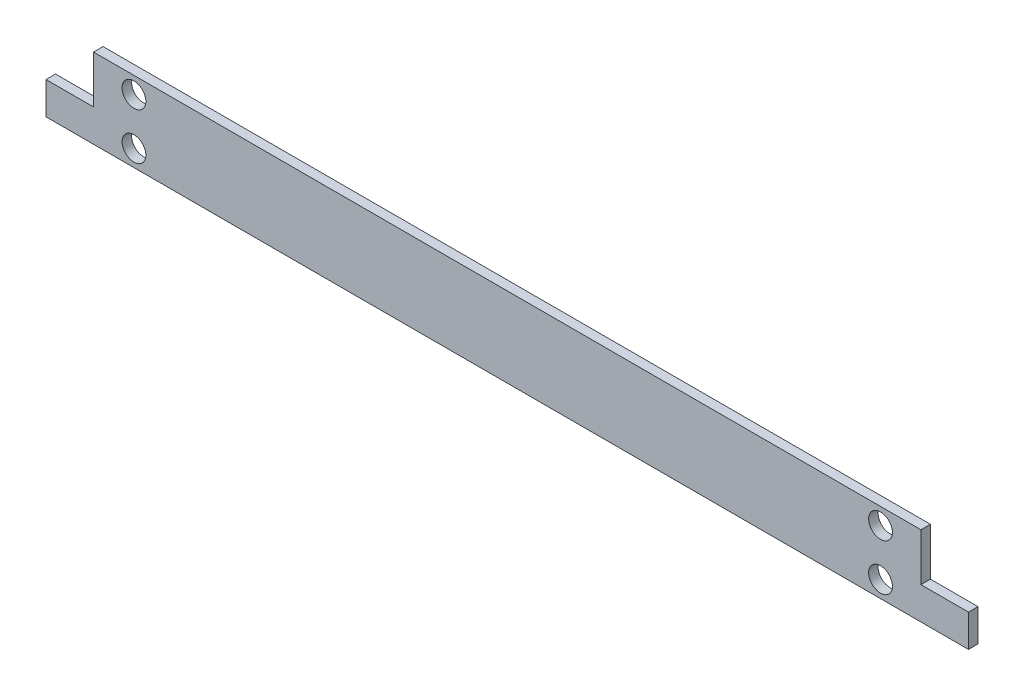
ISO-10303-21;
HEADER;
FILE_DESCRIPTION(('STEP AP214'),'2;1');
FILE_NAME('part.step','',(''),(''),'','','');
FILE_SCHEMA(('AUTOMOTIVE_DESIGN { 1 0 10303 214 1 1 1 1 }'));
ENDSEC;
DATA;
#1=APPLICATION_CONTEXT('core data for automotive mechanical design processes');
#2=APPLICATION_PROTOCOL_DEFINITION('international standard','automotive_design',2000,#1);
#3=PRODUCT_CONTEXT('',#1,'mechanical');
#4=PRODUCT('Part','Part','',(#3));
#5=PRODUCT_RELATED_PRODUCT_CATEGORY('part','',(#4));
#6=PRODUCT_DEFINITION_FORMATION('','',#4);
#7=PRODUCT_DEFINITION_CONTEXT('part definition',#1,'design');
#8=PRODUCT_DEFINITION('design','',#6,#7);
#9=PRODUCT_DEFINITION_SHAPE('','',#8);
#10=(LENGTH_UNIT() NAMED_UNIT(*) SI_UNIT(.MILLI.,.METRE.));
#11=(NAMED_UNIT(*) PLANE_ANGLE_UNIT() SI_UNIT($,.RADIAN.));
#12=(NAMED_UNIT(*) SI_UNIT($,.STERADIAN.) SOLID_ANGLE_UNIT());
#13=UNCERTAINTY_MEASURE_WITH_UNIT(LENGTH_MEASURE(1.E-05),#10,'distance_accuracy_value','');
#14=(GEOMETRIC_REPRESENTATION_CONTEXT(3) GLOBAL_UNCERTAINTY_ASSIGNED_CONTEXT((#13)) GLOBAL_UNIT_ASSIGNED_CONTEXT((#10,
#11,#12)) REPRESENTATION_CONTEXT('',''));
#15=CARTESIAN_POINT('',(0.,0.,0.));
#16=DIRECTION('',(0.,0.,1.));
#17=DIRECTION('',(1.,0.,0.));
#18=AXIS2_PLACEMENT_3D('',#15,#16,#17);
#19=CARTESIAN_POINT('',(233.68,0.,2.54));
#20=DIRECTION('',(1.,0.,0.));
#21=DIRECTION('',(0.,0.,-1.));
#22=AXIS2_PLACEMENT_3D('',#19,#20,#21);
#23=PLANE('',#22);
#24=DIRECTION('',(0.,-1.,0.));
#25=VECTOR('',#24,1.);
#26=CARTESIAN_POINT('',(233.68,0.,0.));
#27=LINE('',#26,#25);
#28=CARTESIAN_POINT('',(233.68,21.336,0.));
#29=VERTEX_POINT('',#28);
#30=CARTESIAN_POINT('',(233.68,8.636,0.));
#31=VERTEX_POINT('',#30);
#32=EDGE_CURVE('E157',#29,#31,#27,.T.);
#33=ORIENTED_EDGE('',*,*,#32,.F.);
#34=DIRECTION('',(0.,0.,-1.));
#35=VECTOR('',#34,1.);
#36=CARTESIAN_POINT('',(233.68,21.336,2.54));
#37=LINE('',#36,#35);
#38=CARTESIAN_POINT('',(233.68,21.336,2.54));
#39=VERTEX_POINT('',#38);
#40=EDGE_CURVE('E11',#39,#29,#37,.T.);
#41=ORIENTED_EDGE('',*,*,#40,.F.);
#42=DIRECTION('',(0.,-1.,0.));
#43=VECTOR('',#42,1.);
#44=CARTESIAN_POINT('',(233.68,0.,2.54));
#45=LINE('',#44,#43);
#46=CARTESIAN_POINT('',(233.68,8.636,2.54));
#47=VERTEX_POINT('',#46);
#48=EDGE_CURVE('E241',#39,#47,#45,.T.);
#49=ORIENTED_EDGE('',*,*,#48,.T.);
#50=DIRECTION('',(0.,0.,-1.));
#51=VECTOR('',#50,1.);
#52=CARTESIAN_POINT('',(233.68,8.636,2.54));
#53=LINE('',#52,#51);
#54=EDGE_CURVE('E87',#47,#31,#53,.T.);
#55=ORIENTED_EDGE('',*,*,#54,.T.);
#56=EDGE_LOOP('',(#33,#41,#49,#55));
#57=FACE_BOUND('',#56,.T.);
#58=ADVANCED_FACE('F36',(#57),#23,.T.);
#59=CARTESIAN_POINT('',(0.,21.336,2.54));
#60=DIRECTION('',(0.,1.,0.));
#61=DIRECTION('',(0.,0.,1.));
#62=AXIS2_PLACEMENT_3D('',#59,#60,#61);
#63=PLANE('',#62);
#64=DIRECTION('',(1.,0.,0.));
#65=VECTOR('',#64,1.);
#66=CARTESIAN_POINT('',(0.,21.336,0.));
#67=LINE('',#66,#65);
#68=CARTESIAN_POINT('',(12.7,21.336,0.));
#69=VERTEX_POINT('',#68);
#70=EDGE_CURVE('E151',#69,#29,#67,.T.);
#71=ORIENTED_EDGE('',*,*,#70,.F.);
#72=DIRECTION('',(0.,0.,-1.));
#73=VECTOR('',#72,1.);
#74=CARTESIAN_POINT('',(12.7,21.336,2.54));
#75=LINE('',#74,#73);
#76=CARTESIAN_POINT('',(12.7,21.336,2.54));
#77=VERTEX_POINT('',#76);
#78=EDGE_CURVE('E45',#77,#69,#75,.T.);
#79=ORIENTED_EDGE('',*,*,#78,.F.);
#80=DIRECTION('',(1.,0.,0.));
#81=VECTOR('',#80,1.);
#82=CARTESIAN_POINT('',(0.,21.336,2.54));
#83=LINE('',#82,#81);
#84=EDGE_CURVE('E243',#77,#39,#83,.T.);
#85=ORIENTED_EDGE('',*,*,#84,.T.);
#86=ORIENTED_EDGE('',*,*,#40,.T.);
#87=EDGE_LOOP('',(#71,#79,#85,#86));
#88=FACE_BOUND('',#87,.T.);
#89=ADVANCED_FACE('F156',(#88),#63,.T.);
#90=CARTESIAN_POINT('',(12.7,0.,2.54));
#91=DIRECTION('',(1.,0.,0.));
#92=DIRECTION('',(0.,0.,-1.));
#93=AXIS2_PLACEMENT_3D('',#90,#91,#92);
#94=PLANE('',#93);
#95=DIRECTION('',(0.,-1.,0.));
#96=VECTOR('',#95,1.);
#97=CARTESIAN_POINT('',(12.7,0.,0.));
#98=LINE('',#97,#96);
#99=CARTESIAN_POINT('',(12.7,8.636,0.));
#100=VERTEX_POINT('',#99);
#101=EDGE_CURVE('E142',#69,#100,#98,.T.);
#102=ORIENTED_EDGE('',*,*,#101,.T.);
#103=DIRECTION('',(0.,0.,-1.));
#104=VECTOR('',#103,1.);
#105=CARTESIAN_POINT('',(12.7,8.636,2.54));
#106=LINE('',#105,#104);
#107=CARTESIAN_POINT('',(12.7,8.636,2.54));
#108=VERTEX_POINT('',#107);
#109=EDGE_CURVE('E135',#108,#100,#106,.T.);
#110=ORIENTED_EDGE('',*,*,#109,.F.);
#111=DIRECTION('',(0.,-1.,0.));
#112=VECTOR('',#111,1.);
#113=CARTESIAN_POINT('',(12.7,0.,2.54));
#114=LINE('',#113,#112);
#115=EDGE_CURVE('E144',#77,#108,#114,.T.);
#116=ORIENTED_EDGE('',*,*,#115,.F.);
#117=ORIENTED_EDGE('',*,*,#78,.T.);
#118=EDGE_LOOP('',(#102,#110,#116,#117));
#119=FACE_BOUND('',#118,.T.);
#120=ADVANCED_FACE('F140',(#119),#94,.F.);
#121=CARTESIAN_POINT('',(0.,8.636,2.54));
#122=DIRECTION('',(0.,1.,0.));
#123=DIRECTION('',(0.,0.,1.));
#124=AXIS2_PLACEMENT_3D('',#121,#122,#123);
#125=PLANE('',#124);
#126=DIRECTION('',(1.,0.,0.));
#127=VECTOR('',#126,1.);
#128=CARTESIAN_POINT('',(0.,8.636,0.));
#129=LINE('',#128,#127);
#130=CARTESIAN_POINT('',(0.,8.636,0.));
#131=VERTEX_POINT('',#130);
#132=EDGE_CURVE('E154',#131,#100,#129,.T.);
#133=ORIENTED_EDGE('',*,*,#132,.F.);
#134=DIRECTION('',(0.,0.,-1.));
#135=VECTOR('',#134,1.);
#136=CARTESIAN_POINT('',(0.,8.636,2.54));
#137=LINE('',#136,#135);
#138=CARTESIAN_POINT('',(0.,8.636,2.54));
#139=VERTEX_POINT('',#138);
#140=EDGE_CURVE('E129',#139,#131,#137,.T.);
#141=ORIENTED_EDGE('',*,*,#140,.F.);
#142=DIRECTION('',(1.,0.,0.));
#143=VECTOR('',#142,1.);
#144=CARTESIAN_POINT('',(0.,8.636,2.54));
#145=LINE('',#144,#143);
#146=EDGE_CURVE('E250',#139,#108,#145,.T.);
#147=ORIENTED_EDGE('',*,*,#146,.T.);
#148=ORIENTED_EDGE('',*,*,#109,.T.);
#149=EDGE_LOOP('',(#133,#141,#147,#148));
#150=FACE_BOUND('',#149,.T.);
#151=ADVANCED_FACE('F207',(#150),#125,.T.);
#152=CARTESIAN_POINT('',(0.,0.,2.54));
#153=DIRECTION('',(-1.,0.,0.));
#154=DIRECTION('',(0.,-1.,0.));
#155=AXIS2_PLACEMENT_3D('',#152,#153,#154);
#156=PLANE('',#155);
#157=DIRECTION('',(0.,1.,0.));
#158=VECTOR('',#157,1.);
#159=CARTESIAN_POINT('',(0.,0.,0.));
#160=LINE('',#159,#158);
#161=CARTESIAN_POINT('',(0.,0.,0.));
#162=VERTEX_POINT('',#161);
#163=EDGE_CURVE('E164',#162,#131,#160,.T.);
#164=ORIENTED_EDGE('',*,*,#163,.F.);
#165=DIRECTION('',(0.,0.,-1.));
#166=VECTOR('',#165,1.);
#167=CARTESIAN_POINT('',(0.,0.,2.54));
#168=LINE('',#167,#166);
#169=CARTESIAN_POINT('',(0.,0.,2.54));
#170=VERTEX_POINT('',#169);
#171=EDGE_CURVE('E127',#170,#162,#168,.T.);
#172=ORIENTED_EDGE('',*,*,#171,.F.);
#173=DIRECTION('',(0.,1.,0.));
#174=VECTOR('',#173,1.);
#175=CARTESIAN_POINT('',(0.,0.,2.54));
#176=LINE('',#175,#174);
#177=EDGE_CURVE('E121',#170,#139,#176,.T.);
#178=ORIENTED_EDGE('',*,*,#177,.T.);
#179=ORIENTED_EDGE('',*,*,#140,.T.);
#180=EDGE_LOOP('',(#164,#172,#178,#179));
#181=FACE_BOUND('',#180,.T.);
#182=ADVANCED_FACE('F210',(#181),#156,.T.);
#183=CARTESIAN_POINT('',(0.,0.,2.54));
#184=DIRECTION('',(0.,1.,0.));
#185=DIRECTION('',(0.,0.,1.));
#186=AXIS2_PLACEMENT_3D('',#183,#184,#185);
#187=PLANE('',#186);
#188=DIRECTION('',(1.,0.,0.));
#189=VECTOR('',#188,1.);
#190=CARTESIAN_POINT('',(0.,0.,0.));
#191=LINE('',#190,#189);
#192=CARTESIAN_POINT('',(246.38,0.,0.));
#193=VERTEX_POINT('',#192);
#194=EDGE_CURVE('E126',#162,#193,#191,.T.);
#195=ORIENTED_EDGE('',*,*,#194,.T.);
#196=DIRECTION('',(0.,0.,-1.));
#197=VECTOR('',#196,1.);
#198=CARTESIAN_POINT('',(246.38,0.,2.54));
#199=LINE('',#198,#197);
#200=CARTESIAN_POINT('',(246.38,0.,2.54));
#201=VERTEX_POINT('',#200);
#202=EDGE_CURVE('E111',#201,#193,#199,.T.);
#203=ORIENTED_EDGE('',*,*,#202,.F.);
#204=DIRECTION('',(1.,0.,0.));
#205=VECTOR('',#204,1.);
#206=CARTESIAN_POINT('',(0.,0.,2.54));
#207=LINE('',#206,#205);
#208=EDGE_CURVE('E114',#170,#201,#207,.T.);
#209=ORIENTED_EDGE('',*,*,#208,.F.);
#210=ORIENTED_EDGE('',*,*,#171,.T.);
#211=EDGE_LOOP('',(#195,#203,#209,#210));
#212=FACE_BOUND('',#211,.T.);
#213=ADVANCED_FACE('F124',(#212),#187,.F.);
#214=CARTESIAN_POINT('',(246.38,0.,2.54));
#215=DIRECTION('',(-1.,0.,0.));
#216=DIRECTION('',(0.,0.,1.));
#217=AXIS2_PLACEMENT_3D('',#214,#215,#216);
#218=PLANE('',#217);
#219=DIRECTION('',(0.,1.,0.));
#220=VECTOR('',#219,1.);
#221=CARTESIAN_POINT('',(246.38,0.,0.));
#222=LINE('',#221,#220);
#223=CARTESIAN_POINT('',(246.38,8.636,0.));
#224=VERTEX_POINT('',#223);
#225=EDGE_CURVE('E167',#193,#224,#222,.T.);
#226=ORIENTED_EDGE('',*,*,#225,.T.);
#227=DIRECTION('',(0.,0.,-1.));
#228=VECTOR('',#227,1.);
#229=CARTESIAN_POINT('',(246.38,8.636,2.54));
#230=LINE('',#229,#228);
#231=CARTESIAN_POINT('',(246.38,8.636,2.54));
#232=VERTEX_POINT('',#231);
#233=EDGE_CURVE('E113',#232,#224,#230,.T.);
#234=ORIENTED_EDGE('',*,*,#233,.F.);
#235=DIRECTION('',(0.,1.,0.));
#236=VECTOR('',#235,1.);
#237=CARTESIAN_POINT('',(246.38,0.,2.54));
#238=LINE('',#237,#236);
#239=EDGE_CURVE('E106',#201,#232,#238,.T.);
#240=ORIENTED_EDGE('',*,*,#239,.F.);
#241=ORIENTED_EDGE('',*,*,#202,.T.);
#242=EDGE_LOOP('',(#226,#234,#240,#241));
#243=FACE_BOUND('',#242,.T.);
#244=ADVANCED_FACE('F109',(#243),#218,.F.);
#245=CARTESIAN_POINT('',(23.495,4.445,2.54));
#246=DIRECTION('',(0.,0.,-1.));
#247=DIRECTION('',(-1.,0.,0.));
#248=AXIS2_PLACEMENT_3D('',#245,#246,#247);
#249=CYLINDRICAL_SURFACE('',#248,3.175);
#250=CARTESIAN_POINT('',(23.495,4.445,2.54));
#251=DIRECTION('',(0.,0.,1.));
#252=DIRECTION('',(1.,0.,0.));
#253=AXIS2_PLACEMENT_3D('',#250,#251,#252);
#254=CIRCLE('',#253,3.175);
#255=CARTESIAN_POINT('',(26.67,4.445,2.54));
#256=VERTEX_POINT('',#255);
#257=EDGE_CURVE('E240',#256,#256,#254,.T.);
#258=ORIENTED_EDGE('',*,*,#257,.T.);
#259=EDGE_LOOP('',(#258));
#260=FACE_BOUND('',#259,.T.);
#261=CARTESIAN_POINT('',(23.495,4.445,0.));
#262=DIRECTION('',(0.,0.,1.));
#263=DIRECTION('',(1.,0.,0.));
#264=AXIS2_PLACEMENT_3D('',#261,#262,#263);
#265=CIRCLE('',#264,3.175);
#266=CARTESIAN_POINT('',(26.67,4.445,0.));
#267=VERTEX_POINT('',#266);
#268=EDGE_CURVE('E159',#267,#267,#265,.T.);
#269=ORIENTED_EDGE('',*,*,#268,.F.);
#270=EDGE_LOOP('',(#269));
#271=FACE_BOUND('',#270,.T.);
#272=ADVANCED_FACE('F184',(#260,#271),#249,.F.);
#273=CARTESIAN_POINT('',(23.495,16.891,2.54));
#274=DIRECTION('',(0.,0.,-1.));
#275=DIRECTION('',(-1.,0.,0.));
#276=AXIS2_PLACEMENT_3D('',#273,#274,#275);
#277=CYLINDRICAL_SURFACE('',#276,3.175);
#278=CARTESIAN_POINT('',(23.495,16.891,2.54));
#279=DIRECTION('',(0.,0.,1.));
#280=DIRECTION('',(1.,0.,0.));
#281=AXIS2_PLACEMENT_3D('',#278,#279,#280);
#282=CIRCLE('',#281,3.175);
#283=CARTESIAN_POINT('',(26.67,16.891,2.54));
#284=VERTEX_POINT('',#283);
#285=EDGE_CURVE('E238',#284,#284,#282,.T.);
#286=ORIENTED_EDGE('',*,*,#285,.T.);
#287=EDGE_LOOP('',(#286));
#288=FACE_BOUND('',#287,.T.);
#289=CARTESIAN_POINT('',(23.495,16.891,0.));
#290=DIRECTION('',(0.,0.,1.));
#291=DIRECTION('',(1.,0.,0.));
#292=AXIS2_PLACEMENT_3D('',#289,#290,#291);
#293=CIRCLE('',#292,3.175);
#294=CARTESIAN_POINT('',(26.67,16.891,0.));
#295=VERTEX_POINT('',#294);
#296=EDGE_CURVE('E178',#295,#295,#293,.T.);
#297=ORIENTED_EDGE('',*,*,#296,.F.);
#298=EDGE_LOOP('',(#297));
#299=FACE_BOUND('',#298,.T.);
#300=ADVANCED_FACE('F186',(#288,#299),#277,.F.);
#301=CARTESIAN_POINT('',(222.885,16.891,2.54));
#302=DIRECTION('',(0.,0.,-1.));
#303=DIRECTION('',(-1.,0.,0.));
#304=AXIS2_PLACEMENT_3D('',#301,#302,#303);
#305=CYLINDRICAL_SURFACE('',#304,3.175);
#306=CARTESIAN_POINT('',(222.885,16.891,2.54));
#307=DIRECTION('',(0.,0.,1.));
#308=DIRECTION('',(1.,0.,0.));
#309=AXIS2_PLACEMENT_3D('',#306,#307,#308);
#310=CIRCLE('',#309,3.175);
#311=CARTESIAN_POINT('',(226.06,16.891,2.54));
#312=VERTEX_POINT('',#311);
#313=EDGE_CURVE('E234',#312,#312,#310,.T.);
#314=ORIENTED_EDGE('',*,*,#313,.T.);
#315=EDGE_LOOP('',(#314));
#316=FACE_BOUND('',#315,.T.);
#317=CARTESIAN_POINT('',(222.885,16.891,0.));
#318=DIRECTION('',(0.,0.,1.));
#319=DIRECTION('',(1.,0.,0.));
#320=AXIS2_PLACEMENT_3D('',#317,#318,#319);
#321=CIRCLE('',#320,3.175);
#322=CARTESIAN_POINT('',(226.06,16.891,0.));
#323=VERTEX_POINT('',#322);
#324=EDGE_CURVE('E175',#323,#323,#321,.T.);
#325=ORIENTED_EDGE('',*,*,#324,.F.);
#326=EDGE_LOOP('',(#325));
#327=FACE_BOUND('',#326,.T.);
#328=ADVANCED_FACE('F193',(#316,#327),#305,.F.);
#329=CARTESIAN_POINT('',(222.885,4.445,2.54));
#330=DIRECTION('',(0.,0.,-1.));
#331=DIRECTION('',(-1.,0.,0.));
#332=AXIS2_PLACEMENT_3D('',#329,#330,#331);
#333=CYLINDRICAL_SURFACE('',#332,3.175);
#334=CARTESIAN_POINT('',(222.885,4.445,2.54));
#335=DIRECTION('',(0.,0.,1.));
#336=DIRECTION('',(1.,0.,0.));
#337=AXIS2_PLACEMENT_3D('',#334,#335,#336);
#338=CIRCLE('',#337,3.175);
#339=CARTESIAN_POINT('',(226.06,4.445,2.54));
#340=VERTEX_POINT('',#339);
#341=EDGE_CURVE('E169',#340,#340,#338,.T.);
#342=ORIENTED_EDGE('',*,*,#341,.T.);
#343=EDGE_LOOP('',(#342));
#344=FACE_BOUND('',#343,.T.);
#345=CARTESIAN_POINT('',(222.885,4.445,0.));
#346=DIRECTION('',(0.,0.,1.));
#347=DIRECTION('',(1.,0.,0.));
#348=AXIS2_PLACEMENT_3D('',#345,#346,#347);
#349=CIRCLE('',#348,3.175);
#350=CARTESIAN_POINT('',(226.06,4.445,0.));
#351=VERTEX_POINT('',#350);
#352=EDGE_CURVE('E172',#351,#351,#349,.T.);
#353=ORIENTED_EDGE('',*,*,#352,.F.);
#354=EDGE_LOOP('',(#353));
#355=FACE_BOUND('',#354,.T.);
#356=ADVANCED_FACE('F38',(#344,#355),#333,.F.);
#357=CARTESIAN_POINT('',(0.,8.636,2.54));
#358=DIRECTION('',(0.,-1.,0.));
#359=DIRECTION('',(0.,0.,-1.));
#360=AXIS2_PLACEMENT_3D('',#357,#358,#359);
#361=PLANE('',#360);
#362=DIRECTION('',(-1.,0.,0.));
#363=VECTOR('',#362,1.);
#364=CARTESIAN_POINT('',(0.,8.636,0.));
#365=LINE('',#364,#363);
#366=EDGE_CURVE('E80',#224,#31,#365,.T.);
#367=ORIENTED_EDGE('',*,*,#366,.T.);
#368=ORIENTED_EDGE('',*,*,#54,.F.);
#369=DIRECTION('',(-1.,0.,0.));
#370=VECTOR('',#369,1.);
#371=CARTESIAN_POINT('',(0.,8.636,2.54));
#372=LINE('',#371,#370);
#373=EDGE_CURVE('E53',#232,#47,#372,.T.);
#374=ORIENTED_EDGE('',*,*,#373,.F.);
#375=ORIENTED_EDGE('',*,*,#233,.T.);
#376=EDGE_LOOP('',(#367,#368,#374,#375));
#377=FACE_BOUND('',#376,.T.);
#378=ADVANCED_FACE('F217',(#377),#361,.F.);
#379=CARTESIAN_POINT('',(0.,0.,2.54));
#380=DIRECTION('',(0.,0.,1.));
#381=DIRECTION('',(1.,0.,0.));
#382=AXIS2_PLACEMENT_3D('',#379,#380,#381);
#383=PLANE('',#382);
#384=ORIENTED_EDGE('',*,*,#341,.F.);
#385=EDGE_LOOP('',(#384));
#386=FACE_BOUND('',#385,.T.);
#387=ORIENTED_EDGE('',*,*,#313,.F.);
#388=EDGE_LOOP('',(#387));
#389=FACE_BOUND('',#388,.T.);
#390=ORIENTED_EDGE('',*,*,#285,.F.);
#391=EDGE_LOOP('',(#390));
#392=FACE_BOUND('',#391,.T.);
#393=ORIENTED_EDGE('',*,*,#257,.F.);
#394=EDGE_LOOP('',(#393));
#395=FACE_BOUND('',#394,.T.);
#396=ORIENTED_EDGE('',*,*,#48,.F.);
#397=ORIENTED_EDGE('',*,*,#84,.F.);
#398=ORIENTED_EDGE('',*,*,#115,.T.);
#399=ORIENTED_EDGE('',*,*,#146,.F.);
#400=ORIENTED_EDGE('',*,*,#177,.F.);
#401=ORIENTED_EDGE('',*,*,#208,.T.);
#402=ORIENTED_EDGE('',*,*,#239,.T.);
#403=ORIENTED_EDGE('',*,*,#373,.T.);
#404=EDGE_LOOP('',(#396,#397,#398,#399,#400,#401,#402,#403));
#405=FACE_BOUND('',#404,.T.);
#406=ADVANCED_FACE('F118',(#386,#389,#392,#395,#405),#383,.T.);
#407=CARTESIAN_POINT('',(0.,0.,0.));
#408=DIRECTION('',(0.,0.,1.));
#409=DIRECTION('',(1.,0.,0.));
#410=AXIS2_PLACEMENT_3D('',#407,#408,#409);
#411=PLANE('',#410);
#412=ORIENTED_EDGE('',*,*,#352,.T.);
#413=EDGE_LOOP('',(#412));
#414=FACE_BOUND('',#413,.T.);
#415=ORIENTED_EDGE('',*,*,#324,.T.);
#416=EDGE_LOOP('',(#415));
#417=FACE_BOUND('',#416,.T.);
#418=ORIENTED_EDGE('',*,*,#296,.T.);
#419=EDGE_LOOP('',(#418));
#420=FACE_BOUND('',#419,.T.);
#421=ORIENTED_EDGE('',*,*,#268,.T.);
#422=EDGE_LOOP('',(#421));
#423=FACE_BOUND('',#422,.T.);
#424=ORIENTED_EDGE('',*,*,#32,.T.);
#425=ORIENTED_EDGE('',*,*,#366,.F.);
#426=ORIENTED_EDGE('',*,*,#225,.F.);
#427=ORIENTED_EDGE('',*,*,#194,.F.);
#428=ORIENTED_EDGE('',*,*,#163,.T.);
#429=ORIENTED_EDGE('',*,*,#132,.T.);
#430=ORIENTED_EDGE('',*,*,#101,.F.);
#431=ORIENTED_EDGE('',*,*,#70,.T.);
#432=EDGE_LOOP('',(#424,#425,#426,#427,#428,#429,#430,#431));
#433=FACE_BOUND('',#432,.T.);
#434=ADVANCED_FACE('F150',(#414,#417,#420,#423,#433),#411,.F.);
#435=CLOSED_SHELL('',(#58,#89,#120,#151,#182,#213,#244,#272,#300,#328,#356,#378,#406,#434));
#436=MANIFOLD_SOLID_BREP('B2',#435);
#437=ADVANCED_BREP_SHAPE_REPRESENTATION('',(#18,#436),#14);
#438=SHAPE_DEFINITION_REPRESENTATION(#9,#437);
ENDSEC;
END-ISO-10303-21;
